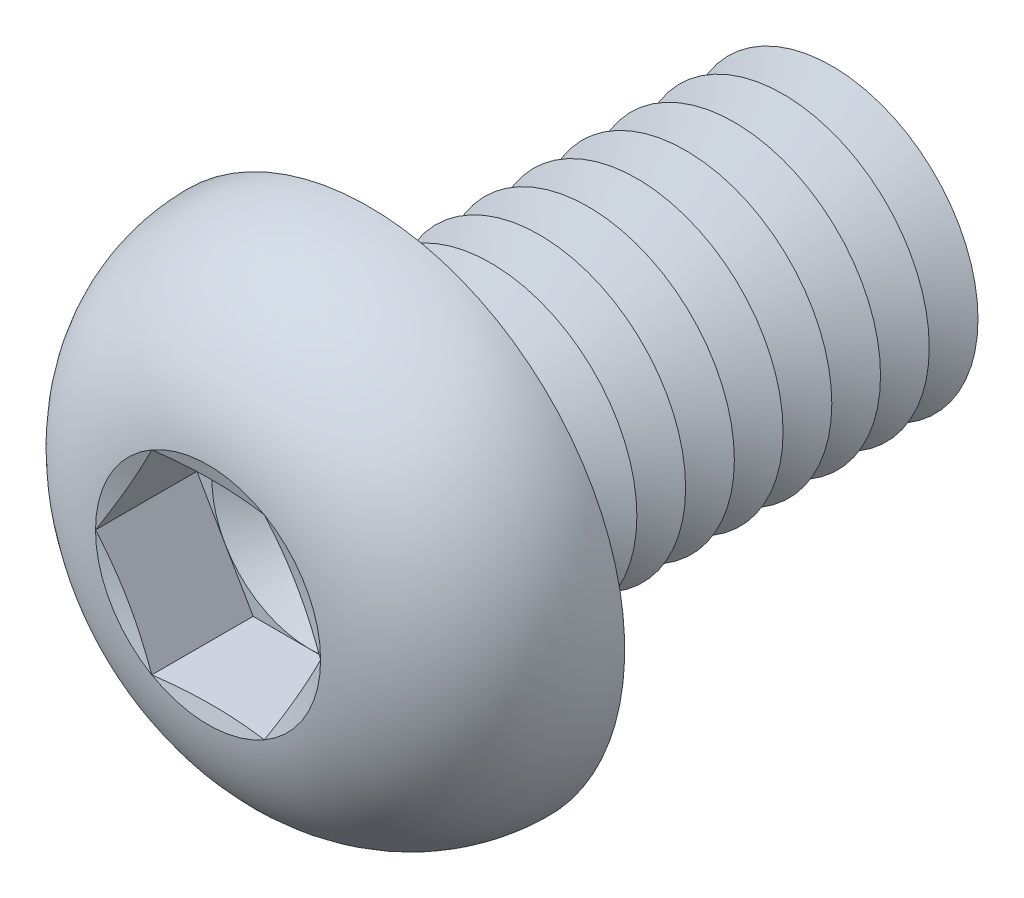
ISO-10303-21;
HEADER;
FILE_DESCRIPTION(('STEP AP214'),'2;1');
FILE_NAME('part.step','',(''),(''),'','','');
FILE_SCHEMA(('AUTOMOTIVE_DESIGN { 1 0 10303 214 1 1 1 1 }'));
ENDSEC;
DATA;
#1=APPLICATION_CONTEXT('core data for automotive mechanical design processes');
#2=APPLICATION_PROTOCOL_DEFINITION('international standard','automotive_design',2000,#1);
#3=PRODUCT_CONTEXT('',#1,'mechanical');
#4=PRODUCT('Part','Part','',(#3));
#5=PRODUCT_RELATED_PRODUCT_CATEGORY('part','',(#4));
#6=PRODUCT_DEFINITION_FORMATION('','',#4);
#7=PRODUCT_DEFINITION_CONTEXT('part definition',#1,'design');
#8=PRODUCT_DEFINITION('design','',#6,#7);
#9=PRODUCT_DEFINITION_SHAPE('','',#8);
#10=(LENGTH_UNIT() NAMED_UNIT(*) SI_UNIT(.MILLI.,.METRE.));
#11=(NAMED_UNIT(*) PLANE_ANGLE_UNIT() SI_UNIT($,.RADIAN.));
#12=(NAMED_UNIT(*) SI_UNIT($,.STERADIAN.) SOLID_ANGLE_UNIT());
#13=UNCERTAINTY_MEASURE_WITH_UNIT(LENGTH_MEASURE(1.E-05),#10,'distance_accuracy_value','');
#14=(GEOMETRIC_REPRESENTATION_CONTEXT(3) GLOBAL_UNCERTAINTY_ASSIGNED_CONTEXT((#13)) GLOBAL_UNIT_ASSIGNED_CONTEXT((#10,
#11,#12)) REPRESENTATION_CONTEXT('',''));
#15=CARTESIAN_POINT('',(0.,0.,0.));
#16=DIRECTION('',(0.,0.,1.));
#17=DIRECTION('',(1.,0.,0.));
#18=AXIS2_PLACEMENT_3D('',#15,#16,#17);
#19=CARTESIAN_POINT('',(0.,0.,1.22));
#20=DIRECTION('',(0.,0.,1.));
#21=DIRECTION('',(1.,0.,0.));
#22=AXIS2_PLACEMENT_3D('',#19,#20,#21);
#23=PLANE('',#22);
#24=CARTESIAN_POINT('',(0.,0.,1.22));
#25=DIRECTION('',(0.,0.,1.));
#26=DIRECTION('',(1.,0.,0.));
#27=AXIS2_PLACEMENT_3D('',#24,#25,#26);
#28=CIRCLE('',#27,1.99999906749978);
#29=CARTESIAN_POINT('',(1.73205,0.999999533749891,1.22));
#30=VERTEX_POINT('',#29);
#31=CARTESIAN_POINT('',(0.,1.99999906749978,1.22));
#32=VERTEX_POINT('',#31);
#33=EDGE_CURVE('E118',#30,#32,#28,.T.);
#34=ORIENTED_EDGE('',*,*,#33,.F.);
#35=DIRECTION('',(-0.5,0.866025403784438,0.));
#36=VECTOR('',#35,1.);
#37=CARTESIAN_POINT('',(2.3094,0.,1.22));
#38=LINE('',#37,#36);
#39=CARTESIAN_POINT('',(1.1547,1.99999906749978,1.22));
#40=VERTEX_POINT('',#39);
#41=EDGE_CURVE('E125',#30,#40,#38,.T.);
#42=ORIENTED_EDGE('',*,*,#41,.T.);
#43=DIRECTION('',(-1.,0.,0.));
#44=VECTOR('',#43,1.);
#45=CARTESIAN_POINT('',(1.1547,1.99999906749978,1.22));
#46=LINE('',#45,#44);
#47=EDGE_CURVE('E136',#40,#32,#46,.T.);
#48=ORIENTED_EDGE('',*,*,#47,.T.);
#49=EDGE_LOOP('',(#34,#42,#48));
#50=FACE_BOUND('',#49,.T.);
#51=ADVANCED_FACE('F39',(#50),#23,.T.);
#52=CARTESIAN_POINT('',(0.,0.,1.22));
#53=DIRECTION('',(0.,0.,1.));
#54=DIRECTION('',(1.,0.,0.));
#55=AXIS2_PLACEMENT_3D('',#52,#53,#54);
#56=CIRCLE('',#55,1.99999906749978);
#57=CARTESIAN_POINT('',(-1.73205,0.999999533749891,1.22));
#58=VERTEX_POINT('',#57);
#59=EDGE_CURVE('E11',#32,#58,#56,.T.);
#60=ORIENTED_EDGE('',*,*,#59,.F.);
#61=CARTESIAN_POINT('',(-1.1547,1.99999906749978,1.22));
#62=VERTEX_POINT('',#61);
#63=EDGE_CURVE('E131',#32,#62,#46,.T.);
#64=ORIENTED_EDGE('',*,*,#63,.T.);
#65=DIRECTION('',(-0.5,-0.866025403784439,0.));
#66=VECTOR('',#65,1.);
#67=CARTESIAN_POINT('',(-1.1547,1.99999906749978,1.22));
#68=LINE('',#67,#66);
#69=EDGE_CURVE('E134',#62,#58,#68,.T.);
#70=ORIENTED_EDGE('',*,*,#69,.T.);
#71=EDGE_LOOP('',(#60,#64,#70));
#72=FACE_BOUND('',#71,.T.);
#73=ADVANCED_FACE('F130',(#72),#23,.T.);
#74=CARTESIAN_POINT('',(-1.73205,-0.999999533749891,1.22));
#75=VERTEX_POINT('',#74);
#76=EDGE_CURVE('E49',#58,#75,#56,.T.);
#77=ORIENTED_EDGE('',*,*,#76,.F.);
#78=CARTESIAN_POINT('',(-2.3094,0.,1.22));
#79=VERTEX_POINT('',#78);
#80=EDGE_CURVE('E143',#58,#79,#68,.T.);
#81=ORIENTED_EDGE('',*,*,#80,.T.);
#82=DIRECTION('',(0.5,-0.866025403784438,0.));
#83=VECTOR('',#82,1.);
#84=CARTESIAN_POINT('',(-2.3094,0.,1.22));
#85=LINE('',#84,#83);
#86=EDGE_CURVE('E152',#79,#75,#85,.T.);
#87=ORIENTED_EDGE('',*,*,#86,.T.);
#88=EDGE_LOOP('',(#77,#81,#87));
#89=FACE_BOUND('',#88,.T.);
#90=ADVANCED_FACE('F348',(#89),#23,.T.);
#91=CARTESIAN_POINT('',(0.,-1.99999906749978,1.22));
#92=VERTEX_POINT('',#91);
#93=EDGE_CURVE('E333',#75,#92,#56,.T.);
#94=ORIENTED_EDGE('',*,*,#93,.F.);
#95=CARTESIAN_POINT('',(-1.1547,-1.99999906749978,1.22));
#96=VERTEX_POINT('',#95);
#97=EDGE_CURVE('E151',#75,#96,#85,.T.);
#98=ORIENTED_EDGE('',*,*,#97,.T.);
#99=DIRECTION('',(1.,0.,0.));
#100=VECTOR('',#99,1.);
#101=CARTESIAN_POINT('',(-1.1547,-1.99999906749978,1.22));
#102=LINE('',#101,#100);
#103=EDGE_CURVE('E157',#96,#92,#102,.T.);
#104=ORIENTED_EDGE('',*,*,#103,.T.);
#105=EDGE_LOOP('',(#94,#98,#104));
#106=FACE_BOUND('',#105,.T.);
#107=ADVANCED_FACE('F341',(#106),#23,.T.);
#108=CARTESIAN_POINT('',(1.73205,-0.999999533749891,1.22));
#109=VERTEX_POINT('',#108);
#110=EDGE_CURVE('E56',#92,#109,#56,.T.);
#111=ORIENTED_EDGE('',*,*,#110,.F.);
#112=CARTESIAN_POINT('',(1.1547,-1.99999906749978,1.22));
#113=VERTEX_POINT('',#112);
#114=EDGE_CURVE('E156',#92,#113,#102,.T.);
#115=ORIENTED_EDGE('',*,*,#114,.T.);
#116=DIRECTION('',(0.5,0.866025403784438,0.));
#117=VECTOR('',#116,1.);
#118=CARTESIAN_POINT('',(1.1547,-1.99999906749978,1.22));
#119=LINE('',#118,#117);
#120=EDGE_CURVE('E162',#113,#109,#119,.T.);
#121=ORIENTED_EDGE('',*,*,#120,.T.);
#122=EDGE_LOOP('',(#111,#115,#121));
#123=FACE_BOUND('',#122,.T.);
#124=ADVANCED_FACE('F388',(#123),#23,.T.);
#125=CARTESIAN_POINT('',(0.,0.,3.3));
#126=DIRECTION('',(0.,0.,1.));
#127=DIRECTION('',(1.,0.,0.));
#128=AXIS2_PLACEMENT_3D('',#125,#126,#127);
#129=CONICAL_SURFACE('',#128,2.3094,1.30899693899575);
#130=CARTESIAN_POINT('',(2.30951547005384,-0.000199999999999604,3.30003094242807));
#131=CARTESIAN_POINT('',(2.26155412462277,0.0828714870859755,3.2871729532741));
#132=CARTESIAN_POINT('',(2.21350580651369,0.16609361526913,3.27549992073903));
#133=CARTESIAN_POINT('',(2.11723944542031,0.332831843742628,3.2549913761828));
#134=CARTESIAN_POINT('',(2.06902134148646,0.416348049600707,3.24615701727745));
#135=CARTESIAN_POINT('',(1.97270782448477,0.583167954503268,3.23184167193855));
#136=CARTESIAN_POINT('',(1.92461306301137,0.666470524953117,3.22634360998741));
#137=CARTESIAN_POINT('',(1.82836219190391,0.83318192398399,3.21897125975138));
#138=CARTESIAN_POINT('',(1.78020609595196,0.91659072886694,3.21709626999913));
#139=CARTESIAN_POINT('',(1.68389390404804,1.08340833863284,3.21709626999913));
#140=CARTESIAN_POINT('',(1.63573780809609,1.16681714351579,3.21897125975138));
#141=CARTESIAN_POINT('',(1.53948693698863,1.33352854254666,3.22634360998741));
#142=CARTESIAN_POINT('',(1.49139217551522,1.41683111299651,3.23184167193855));
#143=CARTESIAN_POINT('',(1.39507865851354,1.58365101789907,3.24615701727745));
#144=CARTESIAN_POINT('',(1.34686055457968,1.66716722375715,3.2549913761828));
#145=CARTESIAN_POINT('',(1.25059419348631,1.83390545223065,3.27549992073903));
#146=CARTESIAN_POINT('',(1.20254587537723,1.91712758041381,3.2871729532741));
#147=CARTESIAN_POINT('',(1.15458452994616,2.00019906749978,3.30003094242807));
#148=B_SPLINE_CURVE_WITH_KNOTS('',3,(#130,#131,#132,#133,#134,#135,#136,#137,#138,#139,#140,
#141,#142,#143,#144,#145,#146,#147),.UNSPECIFIED.,.F.,.F.,(4,2,2,2,2,2,2,2,4),(0.,
0.290357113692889,0.580832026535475,0.869807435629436,1.15872689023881,1.44764634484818,
1.73662175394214,2.02709666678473,2.31745378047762),.UNSPECIFIED.);
#149=CARTESIAN_POINT('',(2.3094,0.,3.3));
#150=VERTEX_POINT('',#149);
#151=CARTESIAN_POINT('',(1.15469999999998,1.99999906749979,3.3));
#152=VERTEX_POINT('',#151);
#153=EDGE_CURVE('E220',#150,#152,#148,.T.);
#154=ORIENTED_EDGE('',*,*,#153,.F.);
#155=CARTESIAN_POINT('',(0.,0.,3.3));
#156=DIRECTION('',(0.,0.,-1.));
#157=DIRECTION('',(-1.,0.,0.));
#158=AXIS2_PLACEMENT_3D('',#155,#156,#157);
#159=CIRCLE('',#158,2.3094);
#160=EDGE_CURVE('E378',#152,#150,#159,.T.);
#161=ORIENTED_EDGE('',*,*,#160,.F.);
#162=EDGE_LOOP('',(#154,#161));
#163=FACE_BOUND('',#162,.T.);
#164=ADVANCED_FACE('F429',(#163),#129,.F.);
#165=CARTESIAN_POINT('',(1.15458452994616,-2.00019906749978,3.30003094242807));
#166=CARTESIAN_POINT('',(1.20254587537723,-1.91712758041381,3.2871729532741));
#167=CARTESIAN_POINT('',(1.25059419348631,-1.83390545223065,3.27549992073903));
#168=CARTESIAN_POINT('',(1.34686055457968,-1.66716722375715,3.2549913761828));
#169=CARTESIAN_POINT('',(1.39507865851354,-1.58365101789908,3.24615701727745));
#170=CARTESIAN_POINT('',(1.49139217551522,-1.41683111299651,3.23184167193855));
#171=CARTESIAN_POINT('',(1.53948693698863,-1.33352854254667,3.22634360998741));
#172=CARTESIAN_POINT('',(1.63573780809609,-1.16681714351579,3.21897125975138));
#173=CARTESIAN_POINT('',(1.68389390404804,-1.08340833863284,3.21709626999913));
#174=CARTESIAN_POINT('',(1.78020609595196,-0.916590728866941,3.21709626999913));
#175=CARTESIAN_POINT('',(1.82836219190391,-0.833181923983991,3.21897125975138));
#176=CARTESIAN_POINT('',(1.92461306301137,-0.666470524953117,3.22634360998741));
#177=CARTESIAN_POINT('',(1.97270782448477,-0.583167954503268,3.23184167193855));
#178=CARTESIAN_POINT('',(2.06902134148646,-0.416348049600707,3.24615701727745));
#179=CARTESIAN_POINT('',(2.11723944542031,-0.332831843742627,3.2549913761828));
#180=CARTESIAN_POINT('',(2.21350580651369,-0.166093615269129,3.27549992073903));
#181=CARTESIAN_POINT('',(2.26155412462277,-0.082871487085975,3.2871729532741));
#182=CARTESIAN_POINT('',(2.30951547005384,0.000200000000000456,3.30003094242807));
#183=B_SPLINE_CURVE_WITH_KNOTS('',3,(#165,#166,#167,#168,#169,#170,#171,#172,#173,#174,#175,
#176,#177,#178,#179,#180,#181,#182),.UNSPECIFIED.,.F.,.F.,(4,2,2,2,2,2,2,2,4),(0.,
0.290357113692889,0.580832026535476,0.869807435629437,1.15872689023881,1.44764634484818,
1.73662175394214,2.02709666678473,2.31745378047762),.UNSPECIFIED.);
#184=CARTESIAN_POINT('',(1.1547,-1.99999906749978,3.3));
#185=VERTEX_POINT('',#184);
#186=EDGE_CURVE('E229',#185,#150,#183,.T.);
#187=ORIENTED_EDGE('',*,*,#186,.F.);
#188=EDGE_CURVE('E380',#150,#185,#159,.T.);
#189=ORIENTED_EDGE('',*,*,#188,.F.);
#190=EDGE_LOOP('',(#187,#189));
#191=FACE_BOUND('',#190,.T.);
#192=ADVANCED_FACE('F434',(#191),#129,.F.);
#193=CARTESIAN_POINT('',(-3.4849337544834,-1.99999906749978,3.75783251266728));
#194=CARTESIAN_POINT('',(-3.40057136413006,-1.99999906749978,3.7382285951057));
#195=CARTESIAN_POINT('',(-3.31617090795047,-1.99999906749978,3.71878852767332));
#196=CARTESIAN_POINT('',(-3.14727791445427,-1.99999906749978,3.68030638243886));
#197=CARTESIAN_POINT('',(-3.06278537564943,-1.99999906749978,3.66126431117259));
#198=CARTESIAN_POINT('',(-2.80911712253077,-1.99999906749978,3.604834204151));
#199=CARTESIAN_POINT('',(-2.63978343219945,-1.99999906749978,3.5681499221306));
#200=CARTESIAN_POINT('',(-2.29895421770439,-1.99999906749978,3.49717072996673));
#201=CARTESIAN_POINT('',(-2.12745330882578,-1.99999906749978,3.4629014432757));
#202=CARTESIAN_POINT('',(-1.78364663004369,-1.99999906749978,3.39849485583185));
#203=CARTESIAN_POINT('',(-1.61134079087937,-1.99999906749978,3.36835791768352));
#204=CARTESIAN_POINT('',(-1.27040784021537,-1.99999906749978,3.31501553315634));
#205=CARTESIAN_POINT('',(-1.10180724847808,-1.99999906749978,3.29164468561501));
#206=CARTESIAN_POINT('',(-0.76364137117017,-1.99999906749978,3.2533727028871));
#207=CARTESIAN_POINT('',(-0.594076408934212,-1.99999906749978,3.23846888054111));
#208=CARTESIAN_POINT('',(-0.33964912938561,-1.99999906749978,3.22431372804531));
#209=CARTESIAN_POINT('',(-0.255009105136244,-1.99999906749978,3.22096057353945));
#210=CARTESIAN_POINT('',(-0.0856618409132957,-1.99999906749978,3.21711210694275));
#211=CARTESIAN_POINT('',(-0.000954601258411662,-1.99999906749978,3.21661678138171));
#212=CARTESIAN_POINT('',(0.168430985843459,-1.99999906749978,3.21851478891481));
#213=CARTESIAN_POINT('',(0.253109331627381,-1.99999906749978,3.22090826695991));
#214=CARTESIAN_POINT('',(0.422344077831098,-1.99999906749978,3.22845792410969));
#215=CARTESIAN_POINT('',(0.506900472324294,-1.99999906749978,3.23361423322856));
#216=CARTESIAN_POINT('',(0.712240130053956,-1.99999906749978,3.24921577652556));
#217=CARTESIAN_POINT('',(0.832922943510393,-1.99999906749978,3.26098285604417));
#218=CARTESIAN_POINT('',(1.07378161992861,-1.99999906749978,3.28874908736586));
#219=CARTESIAN_POINT('',(1.1939575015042,-1.99999906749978,3.30474808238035));
#220=CARTESIAN_POINT('',(1.43419655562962,-1.99999906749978,3.34009172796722));
#221=CARTESIAN_POINT('',(1.55425817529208,-1.99999906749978,3.35944677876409));
#222=CARTESIAN_POINT('',(1.79394991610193,-1.99999906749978,3.40067076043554));
#223=CARTESIAN_POINT('',(1.91358001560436,-1.99999906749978,3.42253981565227));
#224=CARTESIAN_POINT('',(2.15493405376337,-1.99999906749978,3.46864194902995));
#225=CARTESIAN_POINT('',(2.27665041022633,-1.99999906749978,3.49291441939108));
#226=CARTESIAN_POINT('',(2.51977680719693,-1.99999906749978,3.54294628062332));
#227=CARTESIAN_POINT('',(2.64118684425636,-1.99999906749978,3.56870568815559));
#228=CARTESIAN_POINT('',(2.88310060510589,-1.99999906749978,3.6212089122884));
#229=CARTESIAN_POINT('',(3.00360566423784,-1.99999906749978,3.6479466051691));
#230=CARTESIAN_POINT('',(3.24441021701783,-1.99999906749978,3.70229477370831));
#231=CARTESIAN_POINT('',(3.36470972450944,-1.99999906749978,3.7299051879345));
#232=CARTESIAN_POINT('',(3.4849337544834,-1.99999906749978,3.75783251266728));
#233=B_SPLINE_CURVE_WITH_KNOTS('',3,(#193,#194,#195,#196,#197,#198,#199,#200,#201,#202,#203,
#204,#205,#206,#207,#208,#209,#210,#211,#212,#213,#214,#215,#216,#217,#218,#219,#220,#221,#222,
#223,#224,#225,#226,#227,#228,#229,#230,#231,#232),.UNSPECIFIED.,.F.,.F.,(4,2,2,2,2,2,2,2,2,2,2,
2,2,2,2,2,2,2,2,4),(0.,0.259830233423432,0.519664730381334,1.03943435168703,1.56407662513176,
2.08876490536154,2.59926476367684,3.10960251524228,3.36367930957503,3.61775490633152,
3.87184325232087,4.1259435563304,4.48960924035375,4.85326145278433,5.21806142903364,
5.58287945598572,5.95520617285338,6.32753706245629,6.69784064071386,7.06811821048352),.UNSPECIFIED.);
#234=CARTESIAN_POINT('',(-1.1547,-1.99999906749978,3.3));
#235=VERTEX_POINT('',#234);
#236=EDGE_CURVE('E360',#235,#185,#233,.T.);
#237=ORIENTED_EDGE('',*,*,#236,.F.);
#238=EDGE_CURVE('E368',#185,#235,#159,.T.);
#239=ORIENTED_EDGE('',*,*,#238,.F.);
#240=EDGE_LOOP('',(#237,#239));
#241=FACE_BOUND('',#240,.T.);
#242=ADVANCED_FACE('F488',(#241),#129,.F.);
#243=CARTESIAN_POINT('',(-2.30951547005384,0.000200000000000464,3.30003094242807));
#244=CARTESIAN_POINT('',(-2.26155412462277,-0.0828714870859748,3.2871729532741));
#245=CARTESIAN_POINT('',(-2.21350580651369,-0.166093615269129,3.27549992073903));
#246=CARTESIAN_POINT('',(-2.11723944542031,-0.332831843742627,3.2549913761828));
#247=CARTESIAN_POINT('',(-2.06902134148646,-0.416348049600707,3.24615701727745));
#248=CARTESIAN_POINT('',(-1.97270782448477,-0.583167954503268,3.23184167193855));
#249=CARTESIAN_POINT('',(-1.92461306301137,-0.666470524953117,3.22634360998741));
#250=CARTESIAN_POINT('',(-1.82836219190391,-0.833181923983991,3.21897125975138));
#251=CARTESIAN_POINT('',(-1.78020609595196,-0.916590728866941,3.21709626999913));
#252=CARTESIAN_POINT('',(-1.68389390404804,-1.08340833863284,3.21709626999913));
#253=CARTESIAN_POINT('',(-1.63573780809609,-1.16681714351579,3.21897125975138));
#254=CARTESIAN_POINT('',(-1.53948693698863,-1.33352854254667,3.22634360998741));
#255=CARTESIAN_POINT('',(-1.49139217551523,-1.41683111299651,3.23184167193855));
#256=CARTESIAN_POINT('',(-1.39507865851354,-1.58365101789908,3.24615701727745));
#257=CARTESIAN_POINT('',(-1.34686055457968,-1.66716722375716,3.2549913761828));
#258=CARTESIAN_POINT('',(-1.25059419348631,-1.83390545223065,3.27549992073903));
#259=CARTESIAN_POINT('',(-1.20254587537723,-1.91712758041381,3.2871729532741));
#260=CARTESIAN_POINT('',(-1.15458452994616,-2.00019906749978,3.30003094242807));
#261=B_SPLINE_CURVE_WITH_KNOTS('',3,(#243,#244,#245,#246,#247,#248,#249,#250,#251,#252,#253,
#254,#255,#256,#257,#258,#259,#260),.UNSPECIFIED.,.F.,.F.,(4,2,2,2,2,2,2,2,4),(0.,
0.290357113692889,0.580832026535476,0.869807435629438,1.15872689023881,1.44764634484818,
1.73662175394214,2.02709666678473,2.31745378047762),.UNSPECIFIED.);
#262=CARTESIAN_POINT('',(-2.3094,0.,3.3));
#263=VERTEX_POINT('',#262);
#264=EDGE_CURVE('E353',#263,#235,#261,.T.);
#265=ORIENTED_EDGE('',*,*,#264,.F.);
#266=EDGE_CURVE('E315',#235,#263,#159,.T.);
#267=ORIENTED_EDGE('',*,*,#266,.F.);
#268=EDGE_LOOP('',(#265,#267));
#269=FACE_BOUND('',#268,.T.);
#270=ADVANCED_FACE('F357',(#269),#129,.F.);
#271=CARTESIAN_POINT('',(-1.15458452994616,2.00019906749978,3.30003094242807));
#272=CARTESIAN_POINT('',(-1.20254587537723,1.91712758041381,3.2871729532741));
#273=CARTESIAN_POINT('',(-1.25059419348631,1.83390545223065,3.27549992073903));
#274=CARTESIAN_POINT('',(-1.34686055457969,1.66716722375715,3.2549913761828));
#275=CARTESIAN_POINT('',(-1.39507865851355,1.58365101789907,3.24615701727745));
#276=CARTESIAN_POINT('',(-1.49139217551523,1.41683111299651,3.23184167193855));
#277=CARTESIAN_POINT('',(-1.53948693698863,1.33352854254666,3.22634360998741));
#278=CARTESIAN_POINT('',(-1.63573780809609,1.16681714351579,3.21897125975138));
#279=CARTESIAN_POINT('',(-1.68389390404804,1.08340833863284,3.21709626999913));
#280=CARTESIAN_POINT('',(-1.78020609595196,0.91659072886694,3.21709626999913));
#281=CARTESIAN_POINT('',(-1.82836219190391,0.83318192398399,3.21897125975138));
#282=CARTESIAN_POINT('',(-1.92461306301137,0.666470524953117,3.22634360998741));
#283=CARTESIAN_POINT('',(-1.97270782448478,0.583167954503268,3.23184167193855));
#284=CARTESIAN_POINT('',(-2.06902134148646,0.416348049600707,3.24615701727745));
#285=CARTESIAN_POINT('',(-2.11723944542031,0.332831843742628,3.2549913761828));
#286=CARTESIAN_POINT('',(-2.21350580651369,0.16609361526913,3.27549992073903));
#287=CARTESIAN_POINT('',(-2.26155412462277,0.0828714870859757,3.2871729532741));
#288=CARTESIAN_POINT('',(-2.30951547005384,-0.000199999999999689,3.30003094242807));
#289=B_SPLINE_CURVE_WITH_KNOTS('',3,(#271,#272,#273,#274,#275,#276,#277,#278,#279,#280,#281,
#282,#283,#284,#285,#286,#287,#288),.UNSPECIFIED.,.F.,.F.,(4,2,2,2,2,2,2,2,4),(0.,
0.290357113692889,0.580832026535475,0.869807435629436,1.15872689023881,1.44764634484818,
1.73662175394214,2.02709666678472,2.31745378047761),.UNSPECIFIED.);
#290=CARTESIAN_POINT('',(-1.1547,1.99999906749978,3.3));
#291=VERTEX_POINT('',#290);
#292=EDGE_CURVE('E194',#291,#263,#289,.T.);
#293=ORIENTED_EDGE('',*,*,#292,.F.);
#294=EDGE_CURVE('E316',#263,#291,#159,.T.);
#295=ORIENTED_EDGE('',*,*,#294,.F.);
#296=EDGE_LOOP('',(#293,#295));
#297=FACE_BOUND('',#296,.T.);
#298=ADVANCED_FACE('F370',(#297),#129,.F.);
#299=CARTESIAN_POINT('',(0.,0.,-6.5));
#300=DIRECTION('',(0.,0.,1.));
#301=DIRECTION('',(1.,0.,0.));
#302=AXIS2_PLACEMENT_3D('',#299,#300,#301);
#303=CONICAL_SURFACE('',#302,3.,1.0471975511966);
#304=CARTESIAN_POINT('',(0.,0.,-7.));
#305=DIRECTION('',(0.,0.,1.));
#306=DIRECTION('',(1.,0.,0.));
#307=AXIS2_PLACEMENT_3D('',#304,#305,#306);
#308=CIRCLE('',#307,2.13397459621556);
#309=CARTESIAN_POINT('',(2.13397459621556,0.,-7.));
#310=VERTEX_POINT('',#309);
#311=EDGE_CURVE('E287',#310,#310,#308,.T.);
#312=ORIENTED_EDGE('',*,*,#311,.T.);
#313=EDGE_LOOP('',(#312));
#314=FACE_BOUND('',#313,.T.);
#315=CARTESIAN_POINT('',(0.,0.,-6.5));
#316=DIRECTION('',(0.,0.,1.));
#317=DIRECTION('',(1.,0.,0.));
#318=AXIS2_PLACEMENT_3D('',#315,#316,#317);
#319=CIRCLE('',#318,3.);
#320=CARTESIAN_POINT('',(3.,0.,-6.5));
#321=VERTEX_POINT('',#320);
#322=EDGE_CURVE('E283',#321,#321,#319,.T.);
#323=ORIENTED_EDGE('',*,*,#322,.F.);
#324=EDGE_LOOP('',(#323));
#325=FACE_BOUND('',#324,.T.);
#326=ADVANCED_FACE('F478',(#314,#325),#303,.T.);
#327=CARTESIAN_POINT('',(0.,0.,-7.));
#328=DIRECTION('',(0.,0.,-1.));
#329=DIRECTION('',(-1.,0.,0.));
#330=AXIS2_PLACEMENT_3D('',#327,#328,#329);
#331=CONICAL_SURFACE('',#330,2.13397459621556,1.0471975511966);
#332=CARTESIAN_POINT('',(0.,0.,-7.5));
#333=DIRECTION('',(0.,0.,1.));
#334=DIRECTION('',(1.,0.,0.));
#335=AXIS2_PLACEMENT_3D('',#332,#333,#334);
#336=CIRCLE('',#335,3.);
#337=CARTESIAN_POINT('',(3.,0.,-7.5));
#338=VERTEX_POINT('',#337);
#339=EDGE_CURVE('E291',#338,#338,#336,.T.);
#340=ORIENTED_EDGE('',*,*,#339,.T.);
#341=EDGE_LOOP('',(#340));
#342=FACE_BOUND('',#341,.T.);
#343=ORIENTED_EDGE('',*,*,#311,.F.);
#344=EDGE_LOOP('',(#343));
#345=FACE_BOUND('',#344,.T.);
#346=ADVANCED_FACE('F672',(#342,#345),#331,.T.);
#347=CARTESIAN_POINT('',(0.,3.00000000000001,-10.));
#348=DIRECTION('',(0.,0.,-1.));
#349=DIRECTION('',(-1.,0.,0.));
#350=AXIS2_PLACEMENT_3D('',#347,#348,#349);
#351=PLANE('',#350);
#352=CARTESIAN_POINT('',(0.,0.,-10.));
#353=DIRECTION('',(0.,0.,1.));
#354=DIRECTION('',(1.,0.,0.));
#355=AXIS2_PLACEMENT_3D('',#352,#353,#354);
#356=CIRCLE('',#355,2.13397459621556);
#357=CARTESIAN_POINT('',(2.13397459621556,0.,-10.));
#358=VERTEX_POINT('',#357);
#359=EDGE_CURVE('E311',#358,#358,#356,.T.);
#360=ORIENTED_EDGE('',*,*,#359,.F.);
#361=EDGE_LOOP('',(#360));
#362=FACE_BOUND('',#361,.T.);
#363=ADVANCED_FACE('F677',(#362),#351,.T.);
#364=CARTESIAN_POINT('',(0.,0.,-9.5));
#365=DIRECTION('',(0.,0.,1.));
#366=DIRECTION('',(1.,0.,0.));
#367=AXIS2_PLACEMENT_3D('',#364,#365,#366);
#368=CONICAL_SURFACE('',#367,3.,1.0471975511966);
#369=ORIENTED_EDGE('',*,*,#359,.T.);
#370=EDGE_LOOP('',(#369));
#371=FACE_BOUND('',#370,.T.);
#372=CARTESIAN_POINT('',(0.,0.,-9.5));
#373=DIRECTION('',(0.,0.,1.));
#374=DIRECTION('',(1.,0.,0.));
#375=AXIS2_PLACEMENT_3D('',#372,#373,#374);
#376=CIRCLE('',#375,3.);
#377=CARTESIAN_POINT('',(3.,0.,-9.5));
#378=VERTEX_POINT('',#377);
#379=EDGE_CURVE('E307',#378,#378,#376,.T.);
#380=ORIENTED_EDGE('',*,*,#379,.F.);
#381=EDGE_LOOP('',(#380));
#382=FACE_BOUND('',#381,.T.);
#383=ADVANCED_FACE('F665',(#371,#382),#368,.T.);
#384=CARTESIAN_POINT('',(0.,0.,-9.));
#385=DIRECTION('',(0.,0.,-1.));
#386=DIRECTION('',(-1.,0.,0.));
#387=AXIS2_PLACEMENT_3D('',#384,#385,#386);
#388=CONICAL_SURFACE('',#387,2.13397459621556,1.0471975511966);
#389=ORIENTED_EDGE('',*,*,#379,.T.);
#390=EDGE_LOOP('',(#389));
#391=FACE_BOUND('',#390,.T.);
#392=CARTESIAN_POINT('',(0.,0.,-9.));
#393=DIRECTION('',(0.,0.,1.));
#394=DIRECTION('',(1.,0.,0.));
#395=AXIS2_PLACEMENT_3D('',#392,#393,#394);
#396=CIRCLE('',#395,2.13397459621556);
#397=CARTESIAN_POINT('',(2.13397459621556,0.,-9.));
#398=VERTEX_POINT('',#397);
#399=EDGE_CURVE('E303',#398,#398,#396,.T.);
#400=ORIENTED_EDGE('',*,*,#399,.F.);
#401=EDGE_LOOP('',(#400));
#402=FACE_BOUND('',#401,.T.);
#403=ADVANCED_FACE('F655',(#391,#402),#388,.T.);
#404=CARTESIAN_POINT('',(0.,0.,-8.5));
#405=DIRECTION('',(0.,0.,1.));
#406=DIRECTION('',(1.,0.,0.));
#407=AXIS2_PLACEMENT_3D('',#404,#405,#406);
#408=CONICAL_SURFACE('',#407,3.,1.0471975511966);
#409=ORIENTED_EDGE('',*,*,#399,.T.);
#410=EDGE_LOOP('',(#409));
#411=FACE_BOUND('',#410,.T.);
#412=CARTESIAN_POINT('',(0.,0.,-8.5));
#413=DIRECTION('',(0.,0.,1.));
#414=DIRECTION('',(1.,0.,0.));
#415=AXIS2_PLACEMENT_3D('',#412,#413,#414);
#416=CIRCLE('',#415,3.);
#417=CARTESIAN_POINT('',(3.,0.,-8.5));
#418=VERTEX_POINT('',#417);
#419=EDGE_CURVE('E299',#418,#418,#416,.T.);
#420=ORIENTED_EDGE('',*,*,#419,.F.);
#421=EDGE_LOOP('',(#420));
#422=FACE_BOUND('',#421,.T.);
#423=ADVANCED_FACE('F645',(#411,#422),#408,.T.);
#424=CARTESIAN_POINT('',(0.,0.,-8.));
#425=DIRECTION('',(0.,0.,-1.));
#426=DIRECTION('',(-1.,0.,0.));
#427=AXIS2_PLACEMENT_3D('',#424,#425,#426);
#428=CONICAL_SURFACE('',#427,2.13397459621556,1.0471975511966);
#429=ORIENTED_EDGE('',*,*,#419,.T.);
#430=EDGE_LOOP('',(#429));
#431=FACE_BOUND('',#430,.T.);
#432=CARTESIAN_POINT('',(0.,0.,-8.));
#433=DIRECTION('',(0.,0.,1.));
#434=DIRECTION('',(1.,0.,0.));
#435=AXIS2_PLACEMENT_3D('',#432,#433,#434);
#436=CIRCLE('',#435,2.13397459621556);
#437=CARTESIAN_POINT('',(2.13397459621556,0.,-8.));
#438=VERTEX_POINT('',#437);
#439=EDGE_CURVE('E295',#438,#438,#436,.T.);
#440=ORIENTED_EDGE('',*,*,#439,.F.);
#441=EDGE_LOOP('',(#440));
#442=FACE_BOUND('',#441,.T.);
#443=ADVANCED_FACE('F635',(#431,#442),#428,.T.);
#444=CARTESIAN_POINT('',(0.,0.,-7.5));
#445=DIRECTION('',(0.,0.,1.));
#446=DIRECTION('',(1.,0.,0.));
#447=AXIS2_PLACEMENT_3D('',#444,#445,#446);
#448=CONICAL_SURFACE('',#447,3.,1.0471975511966);
#449=ORIENTED_EDGE('',*,*,#439,.T.);
#450=EDGE_LOOP('',(#449));
#451=FACE_BOUND('',#450,.T.);
#452=ORIENTED_EDGE('',*,*,#339,.F.);
#453=EDGE_LOOP('',(#452));
#454=FACE_BOUND('',#453,.T.);
#455=ADVANCED_FACE('F625',(#451,#454),#448,.T.);
#456=CARTESIAN_POINT('',(0.,0.,-5.5));
#457=DIRECTION('',(0.,0.,1.));
#458=DIRECTION('',(1.,0.,0.));
#459=AXIS2_PLACEMENT_3D('',#456,#457,#458);
#460=CONICAL_SURFACE('',#459,3.,1.0471975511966);
#461=CARTESIAN_POINT('',(0.,0.,-6.));
#462=DIRECTION('',(0.,0.,1.));
#463=DIRECTION('',(1.,0.,0.));
#464=AXIS2_PLACEMENT_3D('',#461,#462,#463);
#465=CIRCLE('',#464,2.13397459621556);
#466=CARTESIAN_POINT('',(2.13397459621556,0.,-6.));
#467=VERTEX_POINT('',#466);
#468=EDGE_CURVE('E279',#467,#467,#465,.T.);
#469=ORIENTED_EDGE('',*,*,#468,.T.);
#470=EDGE_LOOP('',(#469));
#471=FACE_BOUND('',#470,.T.);
#472=CARTESIAN_POINT('',(0.,0.,-5.5));
#473=DIRECTION('',(0.,0.,1.));
#474=DIRECTION('',(1.,0.,0.));
#475=AXIS2_PLACEMENT_3D('',#472,#473,#474);
#476=CIRCLE('',#475,3.);
#477=CARTESIAN_POINT('',(3.,0.,-5.5));
#478=VERTEX_POINT('',#477);
#479=EDGE_CURVE('E275',#478,#478,#476,.T.);
#480=ORIENTED_EDGE('',*,*,#479,.F.);
#481=EDGE_LOOP('',(#480));
#482=FACE_BOUND('',#481,.T.);
#483=ADVANCED_FACE('F615',(#471,#482),#460,.T.);
#484=CARTESIAN_POINT('',(0.,0.,-6.));
#485=DIRECTION('',(0.,0.,-1.));
#486=DIRECTION('',(-1.,0.,0.));
#487=AXIS2_PLACEMENT_3D('',#484,#485,#486);
#488=CONICAL_SURFACE('',#487,2.13397459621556,1.0471975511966);
#489=ORIENTED_EDGE('',*,*,#322,.T.);
#490=EDGE_LOOP('',(#489));
#491=FACE_BOUND('',#490,.T.);
#492=ORIENTED_EDGE('',*,*,#468,.F.);
#493=EDGE_LOOP('',(#492));
#494=FACE_BOUND('',#493,.T.);
#495=ADVANCED_FACE('F605',(#491,#494),#488,.T.);
#496=CARTESIAN_POINT('',(0.,0.,-4.5));
#497=DIRECTION('',(0.,0.,1.));
#498=DIRECTION('',(1.,0.,0.));
#499=AXIS2_PLACEMENT_3D('',#496,#497,#498);
#500=CONICAL_SURFACE('',#499,3.,1.0471975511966);
#501=CARTESIAN_POINT('',(0.,0.,-5.));
#502=DIRECTION('',(0.,0.,1.));
#503=DIRECTION('',(1.,0.,0.));
#504=AXIS2_PLACEMENT_3D('',#501,#502,#503);
#505=CIRCLE('',#504,2.13397459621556);
#506=CARTESIAN_POINT('',(2.13397459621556,0.,-5.));
#507=VERTEX_POINT('',#506);
#508=EDGE_CURVE('E271',#507,#507,#505,.T.);
#509=ORIENTED_EDGE('',*,*,#508,.T.);
#510=EDGE_LOOP('',(#509));
#511=FACE_BOUND('',#510,.T.);
#512=CARTESIAN_POINT('',(0.,0.,-4.5));
#513=DIRECTION('',(0.,0.,1.));
#514=DIRECTION('',(1.,0.,0.));
#515=AXIS2_PLACEMENT_3D('',#512,#513,#514);
#516=CIRCLE('',#515,3.);
#517=CARTESIAN_POINT('',(3.,0.,-4.5));
#518=VERTEX_POINT('',#517);
#519=EDGE_CURVE('E267',#518,#518,#516,.T.);
#520=ORIENTED_EDGE('',*,*,#519,.F.);
#521=EDGE_LOOP('',(#520));
#522=FACE_BOUND('',#521,.T.);
#523=ADVANCED_FACE('F595',(#511,#522),#500,.T.);
#524=CARTESIAN_POINT('',(0.,0.,-5.));
#525=DIRECTION('',(0.,0.,-1.));
#526=DIRECTION('',(-1.,0.,0.));
#527=AXIS2_PLACEMENT_3D('',#524,#525,#526);
#528=CONICAL_SURFACE('',#527,2.13397459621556,1.0471975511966);
#529=ORIENTED_EDGE('',*,*,#479,.T.);
#530=EDGE_LOOP('',(#529));
#531=FACE_BOUND('',#530,.T.);
#532=ORIENTED_EDGE('',*,*,#508,.F.);
#533=EDGE_LOOP('',(#532));
#534=FACE_BOUND('',#533,.T.);
#535=ADVANCED_FACE('F585',(#531,#534),#528,.T.);
#536=CARTESIAN_POINT('',(0.,0.,-3.5));
#537=DIRECTION('',(0.,0.,1.));
#538=DIRECTION('',(1.,0.,0.));
#539=AXIS2_PLACEMENT_3D('',#536,#537,#538);
#540=CONICAL_SURFACE('',#539,3.,1.0471975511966);
#541=CARTESIAN_POINT('',(0.,0.,-4.));
#542=DIRECTION('',(0.,0.,1.));
#543=DIRECTION('',(1.,0.,0.));
#544=AXIS2_PLACEMENT_3D('',#541,#542,#543);
#545=CIRCLE('',#544,2.13397459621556);
#546=CARTESIAN_POINT('',(2.13397459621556,0.,-4.));
#547=VERTEX_POINT('',#546);
#548=EDGE_CURVE('E263',#547,#547,#545,.T.);
#549=ORIENTED_EDGE('',*,*,#548,.T.);
#550=EDGE_LOOP('',(#549));
#551=FACE_BOUND('',#550,.T.);
#552=CARTESIAN_POINT('',(0.,0.,-3.5));
#553=DIRECTION('',(0.,0.,1.));
#554=DIRECTION('',(1.,0.,0.));
#555=AXIS2_PLACEMENT_3D('',#552,#553,#554);
#556=CIRCLE('',#555,3.);
#557=CARTESIAN_POINT('',(3.,0.,-3.5));
#558=VERTEX_POINT('',#557);
#559=EDGE_CURVE('E259',#558,#558,#556,.T.);
#560=ORIENTED_EDGE('',*,*,#559,.F.);
#561=EDGE_LOOP('',(#560));
#562=FACE_BOUND('',#561,.T.);
#563=ADVANCED_FACE('F575',(#551,#562),#540,.T.);
#564=CARTESIAN_POINT('',(0.,0.,-4.));
#565=DIRECTION('',(0.,0.,-1.));
#566=DIRECTION('',(-1.,0.,0.));
#567=AXIS2_PLACEMENT_3D('',#564,#565,#566);
#568=CONICAL_SURFACE('',#567,2.13397459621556,1.0471975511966);
#569=ORIENTED_EDGE('',*,*,#519,.T.);
#570=EDGE_LOOP('',(#569));
#571=FACE_BOUND('',#570,.T.);
#572=ORIENTED_EDGE('',*,*,#548,.F.);
#573=EDGE_LOOP('',(#572));
#574=FACE_BOUND('',#573,.T.);
#575=ADVANCED_FACE('F565',(#571,#574),#568,.T.);
#576=CARTESIAN_POINT('',(0.,0.,-2.5));
#577=DIRECTION('',(0.,0.,1.));
#578=DIRECTION('',(1.,0.,0.));
#579=AXIS2_PLACEMENT_3D('',#576,#577,#578);
#580=CONICAL_SURFACE('',#579,3.,1.0471975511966);
#581=CARTESIAN_POINT('',(0.,0.,-3.));
#582=DIRECTION('',(0.,0.,1.));
#583=DIRECTION('',(1.,0.,0.));
#584=AXIS2_PLACEMENT_3D('',#581,#582,#583);
#585=CIRCLE('',#584,2.13397459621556);
#586=CARTESIAN_POINT('',(2.13397459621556,0.,-3.));
#587=VERTEX_POINT('',#586);
#588=EDGE_CURVE('E255',#587,#587,#585,.T.);
#589=ORIENTED_EDGE('',*,*,#588,.T.);
#590=EDGE_LOOP('',(#589));
#591=FACE_BOUND('',#590,.T.);
#592=CARTESIAN_POINT('',(0.,0.,-2.5));
#593=DIRECTION('',(0.,0.,1.));
#594=DIRECTION('',(1.,0.,0.));
#595=AXIS2_PLACEMENT_3D('',#592,#593,#594);
#596=CIRCLE('',#595,3.);
#597=CARTESIAN_POINT('',(3.,0.,-2.5));
#598=VERTEX_POINT('',#597);
#599=EDGE_CURVE('E251',#598,#598,#596,.T.);
#600=ORIENTED_EDGE('',*,*,#599,.F.);
#601=EDGE_LOOP('',(#600));
#602=FACE_BOUND('',#601,.T.);
#603=ADVANCED_FACE('F555',(#591,#602),#580,.T.);
#604=CARTESIAN_POINT('',(0.,0.,-3.));
#605=DIRECTION('',(0.,0.,-1.));
#606=DIRECTION('',(-1.,0.,0.));
#607=AXIS2_PLACEMENT_3D('',#604,#605,#606);
#608=CONICAL_SURFACE('',#607,2.13397459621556,1.0471975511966);
#609=ORIENTED_EDGE('',*,*,#559,.T.);
#610=EDGE_LOOP('',(#609));
#611=FACE_BOUND('',#610,.T.);
#612=ORIENTED_EDGE('',*,*,#588,.F.);
#613=EDGE_LOOP('',(#612));
#614=FACE_BOUND('',#613,.T.);
#615=ADVANCED_FACE('F545',(#611,#614),#608,.T.);
#616=CARTESIAN_POINT('',(0.,0.,-1.5));
#617=DIRECTION('',(0.,0.,1.));
#618=DIRECTION('',(1.,0.,0.));
#619=AXIS2_PLACEMENT_3D('',#616,#617,#618);
#620=CONICAL_SURFACE('',#619,3.,1.0471975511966);
#621=CARTESIAN_POINT('',(0.,0.,-2.));
#622=DIRECTION('',(0.,0.,1.));
#623=DIRECTION('',(1.,0.,0.));
#624=AXIS2_PLACEMENT_3D('',#621,#622,#623);
#625=CIRCLE('',#624,2.13397459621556);
#626=CARTESIAN_POINT('',(2.13397459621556,0.,-2.));
#627=VERTEX_POINT('',#626);
#628=EDGE_CURVE('E247',#627,#627,#625,.T.);
#629=ORIENTED_EDGE('',*,*,#628,.T.);
#630=EDGE_LOOP('',(#629));
#631=FACE_BOUND('',#630,.T.);
#632=CARTESIAN_POINT('',(0.,0.,-1.5));
#633=DIRECTION('',(0.,0.,1.));
#634=DIRECTION('',(1.,0.,0.));
#635=AXIS2_PLACEMENT_3D('',#632,#633,#634);
#636=CIRCLE('',#635,3.);
#637=CARTESIAN_POINT('',(3.,0.,-1.5));
#638=VERTEX_POINT('',#637);
#639=EDGE_CURVE('E239',#638,#638,#636,.T.);
#640=ORIENTED_EDGE('',*,*,#639,.F.);
#641=EDGE_LOOP('',(#640));
#642=FACE_BOUND('',#641,.T.);
#643=ADVANCED_FACE('F535',(#631,#642),#620,.T.);
#644=CARTESIAN_POINT('',(0.,0.,-2.));
#645=DIRECTION('',(0.,0.,-1.));
#646=DIRECTION('',(-1.,0.,0.));
#647=AXIS2_PLACEMENT_3D('',#644,#645,#646);
#648=CONICAL_SURFACE('',#647,2.13397459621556,1.0471975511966);
#649=ORIENTED_EDGE('',*,*,#599,.T.);
#650=EDGE_LOOP('',(#649));
#651=FACE_BOUND('',#650,.T.);
#652=ORIENTED_EDGE('',*,*,#628,.F.);
#653=EDGE_LOOP('',(#652));
#654=FACE_BOUND('',#653,.T.);
#655=ADVANCED_FACE('F526',(#651,#654),#648,.T.);
#656=CARTESIAN_POINT('',(0.,0.,-0.499999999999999));
#657=DIRECTION('',(0.,0.,1.));
#658=DIRECTION('',(1.,0.,0.));
#659=AXIS2_PLACEMENT_3D('',#656,#657,#658);
#660=CONICAL_SURFACE('',#659,3.,1.0471975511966);
#661=CARTESIAN_POINT('',(0.,0.,-0.999999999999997));
#662=DIRECTION('',(0.,0.,1.));
#663=DIRECTION('',(1.,0.,0.));
#664=AXIS2_PLACEMENT_3D('',#661,#662,#663);
#665=CIRCLE('',#664,2.13397459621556);
#666=CARTESIAN_POINT('',(2.13397459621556,0.,-0.999999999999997));
#667=VERTEX_POINT('',#666);
#668=EDGE_CURVE('E228',#667,#667,#665,.T.);
#669=ORIENTED_EDGE('',*,*,#668,.T.);
#670=EDGE_LOOP('',(#669));
#671=FACE_BOUND('',#670,.T.);
#672=CARTESIAN_POINT('',(0.,0.,-0.499999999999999));
#673=DIRECTION('',(0.,0.,1.));
#674=DIRECTION('',(1.,0.,0.));
#675=AXIS2_PLACEMENT_3D('',#672,#673,#674);
#676=CIRCLE('',#675,3.);
#677=CARTESIAN_POINT('',(3.,0.,-0.499999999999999));
#678=VERTEX_POINT('',#677);
#679=EDGE_CURVE('E243',#678,#678,#676,.T.);
#680=ORIENTED_EDGE('',*,*,#679,.F.);
#681=EDGE_LOOP('',(#680));
#682=FACE_BOUND('',#681,.T.);
#683=ADVANCED_FACE('F517',(#671,#682),#660,.T.);
#684=CARTESIAN_POINT('',(0.,0.,-0.999999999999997));
#685=DIRECTION('',(0.,0.,-1.));
#686=DIRECTION('',(-1.,0.,0.));
#687=AXIS2_PLACEMENT_3D('',#684,#685,#686);
#688=CONICAL_SURFACE('',#687,2.13397459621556,1.0471975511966);
#689=ORIENTED_EDGE('',*,*,#639,.T.);
#690=EDGE_LOOP('',(#689));
#691=FACE_BOUND('',#690,.T.);
#692=ORIENTED_EDGE('',*,*,#668,.F.);
#693=EDGE_LOOP('',(#692));
#694=FACE_BOUND('',#693,.T.);
#695=ADVANCED_FACE('F217',(#691,#694),#688,.T.);
#696=CARTESIAN_POINT('',(3.4849337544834,1.99999906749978,3.75783251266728));
#697=CARTESIAN_POINT('',(3.40057136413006,1.99999906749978,3.7382285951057));
#698=CARTESIAN_POINT('',(3.31617090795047,1.99999906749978,3.71878852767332));
#699=CARTESIAN_POINT('',(3.14727791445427,1.99999906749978,3.68030638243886));
#700=CARTESIAN_POINT('',(3.06278537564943,1.99999906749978,3.66126431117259));
#701=CARTESIAN_POINT('',(2.80911712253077,1.99999906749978,3.604834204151));
#702=CARTESIAN_POINT('',(2.63978343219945,1.99999906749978,3.5681499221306));
#703=CARTESIAN_POINT('',(2.29895421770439,1.99999906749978,3.49717072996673));
#704=CARTESIAN_POINT('',(2.12745330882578,1.99999906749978,3.4629014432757));
#705=CARTESIAN_POINT('',(1.78364663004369,1.99999906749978,3.39849485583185));
#706=CARTESIAN_POINT('',(1.61134079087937,1.99999906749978,3.36835791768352));
#707=CARTESIAN_POINT('',(1.27040784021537,1.99999906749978,3.31501553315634));
#708=CARTESIAN_POINT('',(1.10180724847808,1.99999906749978,3.29164468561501));
#709=CARTESIAN_POINT('',(0.763641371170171,1.99999906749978,3.2533727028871));
#710=CARTESIAN_POINT('',(0.594076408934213,1.99999906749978,3.23846888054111));
#711=CARTESIAN_POINT('',(0.339649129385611,1.99999906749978,3.22431372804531));
#712=CARTESIAN_POINT('',(0.255009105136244,1.99999906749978,3.22096057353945));
#713=CARTESIAN_POINT('',(0.0856618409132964,1.99999906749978,3.21711210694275));
#714=CARTESIAN_POINT('',(0.000954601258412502,1.99999906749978,3.2166167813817));
#715=CARTESIAN_POINT('',(-0.168430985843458,1.99999906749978,3.21851478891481));
#716=CARTESIAN_POINT('',(-0.25310933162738,1.99999906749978,3.22090826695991));
#717=CARTESIAN_POINT('',(-0.422344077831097,1.99999906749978,3.22845792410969));
#718=CARTESIAN_POINT('',(-0.506900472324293,1.99999906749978,3.23361423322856));
#719=CARTESIAN_POINT('',(-0.712240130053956,1.99999906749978,3.24921577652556));
#720=CARTESIAN_POINT('',(-0.832922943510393,1.99999906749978,3.26098285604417));
#721=CARTESIAN_POINT('',(-1.07378161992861,1.99999906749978,3.28874908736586));
#722=CARTESIAN_POINT('',(-1.1939575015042,1.99999906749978,3.30474808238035));
#723=CARTESIAN_POINT('',(-1.43419655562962,1.99999906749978,3.34009172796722));
#724=CARTESIAN_POINT('',(-1.55425817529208,1.99999906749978,3.35944677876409));
#725=CARTESIAN_POINT('',(-1.79394991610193,1.99999906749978,3.40067076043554));
#726=CARTESIAN_POINT('',(-1.91358001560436,1.99999906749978,3.42253981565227));
#727=CARTESIAN_POINT('',(-2.15493405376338,1.99999906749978,3.46864194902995));
#728=CARTESIAN_POINT('',(-2.27665041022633,1.99999906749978,3.49291441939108));
#729=CARTESIAN_POINT('',(-2.51977680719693,1.99999906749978,3.54294628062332));
#730=CARTESIAN_POINT('',(-2.64118684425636,1.99999906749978,3.56870568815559));
#731=CARTESIAN_POINT('',(-2.8831006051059,1.99999906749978,3.6212089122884));
#732=CARTESIAN_POINT('',(-3.00360566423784,1.99999906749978,3.6479466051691));
#733=CARTESIAN_POINT('',(-3.24441021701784,1.99999906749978,3.70229477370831));
#734=CARTESIAN_POINT('',(-3.36470972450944,1.99999906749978,3.7299051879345));
#735=CARTESIAN_POINT('',(-3.4849337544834,1.99999906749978,3.75783251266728));
#736=B_SPLINE_CURVE_WITH_KNOTS('',3,(#696,#697,#698,#699,#700,#701,#702,#703,#704,#705,#706,
#707,#708,#709,#710,#711,#712,#713,#714,#715,#716,#717,#718,#719,#720,#721,#722,#723,#724,#725,
#726,#727,#728,#729,#730,#731,#732,#733,#734,#735),.UNSPECIFIED.,.F.,.F.,(4,2,2,2,2,2,2,2,2,2,2,
2,2,2,2,2,2,2,2,4),(0.,0.259830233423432,0.519664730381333,1.03943435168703,1.56407662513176,
2.08876490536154,2.59926476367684,3.10960251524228,3.36367930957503,3.61775490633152,
3.87184325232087,4.1259435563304,4.48960924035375,4.85326145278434,5.21806142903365,
5.58287945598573,5.95520617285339,6.3275370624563,6.69784064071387,7.06811821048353),.UNSPECIFIED.);
#737=EDGE_CURVE('E170',#152,#291,#736,.T.);
#738=ORIENTED_EDGE('',*,*,#737,.F.);
#739=EDGE_CURVE('E321',#291,#152,#159,.T.);
#740=ORIENTED_EDGE('',*,*,#739,.F.);
#741=EDGE_LOOP('',(#738,#740));
#742=FACE_BOUND('',#741,.T.);
#743=ADVANCED_FACE('F201',(#742),#129,.F.);
#744=CARTESIAN_POINT('',(0.,0.,0.));
#745=DIRECTION('',(0.,0.,-1.));
#746=DIRECTION('',(-1.,0.,0.));
#747=AXIS2_PLACEMENT_3D('',#744,#745,#746);
#748=DEGENERATE_TOROIDAL_SURFACE('',#747,1.92803707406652,3.32196292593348,.T.);
#749=ORIENTED_EDGE('',*,*,#294,.T.);
#750=ORIENTED_EDGE('',*,*,#739,.T.);
#751=ORIENTED_EDGE('',*,*,#160,.T.);
#752=ORIENTED_EDGE('',*,*,#188,.T.);
#753=ORIENTED_EDGE('',*,*,#238,.T.);
#754=ORIENTED_EDGE('',*,*,#266,.T.);
#755=EDGE_LOOP('',(#749,#750,#751,#752,#753,#754));
#756=FACE_BOUND('',#755,.T.);
#757=CARTESIAN_POINT('',(0.,0.,0.));
#758=DIRECTION('',(0.,0.,-1.));
#759=DIRECTION('',(-1.,0.,0.));
#760=AXIS2_PLACEMENT_3D('',#757,#758,#759);
#761=CIRCLE('',#760,5.25);
#762=CARTESIAN_POINT('',(-5.25,0.,0.));
#763=VERTEX_POINT('',#762);
#764=EDGE_CURVE('E320',#763,#763,#761,.T.);
#765=ORIENTED_EDGE('',*,*,#764,.F.);
#766=EDGE_LOOP('',(#765));
#767=FACE_BOUND('',#766,.T.);
#768=ADVANCED_FACE('F363',(#756,#767),#748,.T.);
#769=CARTESIAN_POINT('',(0.,3.,0.));
#770=DIRECTION('',(0.,0.,-1.));
#771=DIRECTION('',(-1.,0.,0.));
#772=AXIS2_PLACEMENT_3D('',#769,#770,#771);
#773=PLANE('',#772);
#774=CARTESIAN_POINT('',(0.,0.,0.));
#775=DIRECTION('',(0.,0.,-1.));
#776=DIRECTION('',(-1.,0.,0.));
#777=AXIS2_PLACEMENT_3D('',#774,#775,#776);
#778=CIRCLE('',#777,3.5);
#779=CARTESIAN_POINT('',(-3.5,0.,0.));
#780=VERTEX_POINT('',#779);
#781=EDGE_CURVE('E324',#780,#780,#778,.F.);
#782=ORIENTED_EDGE('',*,*,#781,.T.);
#783=EDGE_LOOP('',(#782));
#784=FACE_BOUND('',#783,.T.);
#785=ORIENTED_EDGE('',*,*,#764,.T.);
#786=EDGE_LOOP('',(#785));
#787=FACE_BOUND('',#786,.T.);
#788=ADVANCED_FACE('F459',(#784,#787),#773,.T.);
#789=CARTESIAN_POINT('',(0.,0.,-0.499999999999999));
#790=DIRECTION('',(0.,0.,-1.));
#791=DIRECTION('',(-1.,0.,0.));
#792=AXIS2_PLACEMENT_3D('',#789,#790,#791);
#793=TOROIDAL_SURFACE('',#792,3.5,0.5);
#794=ORIENTED_EDGE('',*,*,#781,.F.);
#795=EDGE_LOOP('',(#794));
#796=FACE_BOUND('',#795,.T.);
#797=ORIENTED_EDGE('',*,*,#679,.T.);
#798=EDGE_LOOP('',(#797));
#799=FACE_BOUND('',#798,.T.);
#800=ADVANCED_FACE('F41',(#796,#799),#793,.F.);
#801=CARTESIAN_POINT('',(2.3094,0.,1.22));
#802=DIRECTION('',(0.866025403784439,0.5,0.));
#803=DIRECTION('',(-0.5,0.866025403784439,0.));
#804=AXIS2_PLACEMENT_3D('',#801,#802,#803);
#805=PLANE('',#804);
#806=ORIENTED_EDGE('',*,*,#153,.T.);
#807=DIRECTION('',(0.,0.,1.));
#808=VECTOR('',#807,1.);
#809=CARTESIAN_POINT('',(1.1547,1.99999906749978,1.22));
#810=LINE('',#809,#808);
#811=EDGE_CURVE('E64',#40,#152,#810,.T.);
#812=ORIENTED_EDGE('',*,*,#811,.F.);
#813=ORIENTED_EDGE('',*,*,#41,.F.);
#814=CARTESIAN_POINT('',(2.3094,0.,1.22));
#815=VERTEX_POINT('',#814);
#816=EDGE_CURVE('E140',#815,#30,#38,.T.);
#817=ORIENTED_EDGE('',*,*,#816,.F.);
#818=DIRECTION('',(0.,0.,1.));
#819=VECTOR('',#818,1.);
#820=CARTESIAN_POINT('',(2.3094,0.,1.22));
#821=LINE('',#820,#819);
#822=EDGE_CURVE('E166',#815,#150,#821,.T.);
#823=ORIENTED_EDGE('',*,*,#822,.T.);
#824=EDGE_LOOP('',(#806,#812,#813,#817,#823));
#825=FACE_BOUND('',#824,.T.);
#826=ADVANCED_FACE('F211',(#825),#805,.F.);
#827=CARTESIAN_POINT('',(1.1547,-1.99999906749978,1.22));
#828=DIRECTION('',(0.866025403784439,-0.5,0.));
#829=DIRECTION('',(0.5,0.866025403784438,0.));
#830=AXIS2_PLACEMENT_3D('',#827,#828,#829);
#831=PLANE('',#830);
#832=ORIENTED_EDGE('',*,*,#186,.T.);
#833=ORIENTED_EDGE('',*,*,#822,.F.);
#834=EDGE_CURVE('E161',#109,#815,#119,.T.);
#835=ORIENTED_EDGE('',*,*,#834,.F.);
#836=ORIENTED_EDGE('',*,*,#120,.F.);
#837=DIRECTION('',(0.,0.,1.));
#838=VECTOR('',#837,1.);
#839=CARTESIAN_POINT('',(1.1547,-1.99999906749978,1.22));
#840=LINE('',#839,#838);
#841=EDGE_CURVE('E171',#113,#185,#840,.T.);
#842=ORIENTED_EDGE('',*,*,#841,.T.);
#843=EDGE_LOOP('',(#832,#833,#835,#836,#842));
#844=FACE_BOUND('',#843,.T.);
#845=ADVANCED_FACE('F215',(#844),#831,.F.);
#846=CARTESIAN_POINT('',(-1.1547,-1.99999906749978,1.22));
#847=DIRECTION('',(0.,-1.,0.));
#848=DIRECTION('',(0.,0.,-1.));
#849=AXIS2_PLACEMENT_3D('',#846,#847,#848);
#850=PLANE('',#849);
#851=ORIENTED_EDGE('',*,*,#236,.T.);
#852=ORIENTED_EDGE('',*,*,#841,.F.);
#853=ORIENTED_EDGE('',*,*,#114,.F.);
#854=ORIENTED_EDGE('',*,*,#103,.F.);
#855=DIRECTION('',(0.,0.,1.));
#856=VECTOR('',#855,1.);
#857=CARTESIAN_POINT('',(-1.1547,-1.99999906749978,1.22));
#858=LINE('',#857,#856);
#859=EDGE_CURVE('E175',#96,#235,#858,.T.);
#860=ORIENTED_EDGE('',*,*,#859,.T.);
#861=EDGE_LOOP('',(#851,#852,#853,#854,#860));
#862=FACE_BOUND('',#861,.T.);
#863=ADVANCED_FACE('F391',(#862),#850,.F.);
#864=CARTESIAN_POINT('',(-2.3094,0.,1.22));
#865=DIRECTION('',(-0.866025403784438,-0.5,0.));
#866=DIRECTION('',(0.5,-0.866025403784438,0.));
#867=AXIS2_PLACEMENT_3D('',#864,#865,#866);
#868=PLANE('',#867);
#869=ORIENTED_EDGE('',*,*,#264,.T.);
#870=ORIENTED_EDGE('',*,*,#859,.F.);
#871=ORIENTED_EDGE('',*,*,#97,.F.);
#872=ORIENTED_EDGE('',*,*,#86,.F.);
#873=DIRECTION('',(0.,0.,1.));
#874=VECTOR('',#873,1.);
#875=CARTESIAN_POINT('',(-2.3094,0.,1.22));
#876=LINE('',#875,#874);
#877=EDGE_CURVE('E179',#79,#263,#876,.T.);
#878=ORIENTED_EDGE('',*,*,#877,.T.);
#879=EDGE_LOOP('',(#869,#870,#871,#872,#878));
#880=FACE_BOUND('',#879,.T.);
#881=ADVANCED_FACE('F346',(#880),#868,.F.);
#882=CARTESIAN_POINT('',(-1.1547,1.99999906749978,1.22));
#883=DIRECTION('',(-0.866025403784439,0.5,0.));
#884=DIRECTION('',(-0.5,-0.866025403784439,0.));
#885=AXIS2_PLACEMENT_3D('',#882,#883,#884);
#886=PLANE('',#885);
#887=ORIENTED_EDGE('',*,*,#292,.T.);
#888=ORIENTED_EDGE('',*,*,#877,.F.);
#889=ORIENTED_EDGE('',*,*,#80,.F.);
#890=ORIENTED_EDGE('',*,*,#69,.F.);
#891=DIRECTION('',(0.,0.,1.));
#892=VECTOR('',#891,1.);
#893=CARTESIAN_POINT('',(-1.1547,1.99999906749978,1.22));
#894=LINE('',#893,#892);
#895=EDGE_CURVE('E138',#62,#291,#894,.T.);
#896=ORIENTED_EDGE('',*,*,#895,.T.);
#897=EDGE_LOOP('',(#887,#888,#889,#890,#896));
#898=FACE_BOUND('',#897,.T.);
#899=ADVANCED_FACE('F208',(#898),#886,.F.);
#900=CARTESIAN_POINT('',(1.1547,1.99999906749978,1.22));
#901=DIRECTION('',(0.,1.,0.));
#902=DIRECTION('',(-1.,0.,0.));
#903=AXIS2_PLACEMENT_3D('',#900,#901,#902);
#904=PLANE('',#903);
#905=ORIENTED_EDGE('',*,*,#737,.T.);
#906=ORIENTED_EDGE('',*,*,#895,.F.);
#907=ORIENTED_EDGE('',*,*,#63,.F.);
#908=ORIENTED_EDGE('',*,*,#47,.F.);
#909=ORIENTED_EDGE('',*,*,#811,.T.);
#910=EDGE_LOOP('',(#905,#906,#907,#908,#909));
#911=FACE_BOUND('',#910,.T.);
#912=ADVANCED_FACE('F135',(#911),#904,.F.);
#913=EDGE_CURVE('E43',#109,#30,#56,.T.);
#914=ORIENTED_EDGE('',*,*,#913,.F.);
#915=ORIENTED_EDGE('',*,*,#834,.T.);
#916=ORIENTED_EDGE('',*,*,#816,.T.);
#917=EDGE_LOOP('',(#914,#915,#916));
#918=FACE_BOUND('',#917,.T.);
#919=ADVANCED_FACE('F115',(#918),#23,.T.);
#920=CARTESIAN_POINT('',(0.,0.,1.22));
#921=DIRECTION('',(0.,0.,1.));
#922=DIRECTION('',(1.,0.,0.));
#923=AXIS2_PLACEMENT_3D('',#920,#921,#922);
#924=CONICAL_SURFACE('',#923,1.99999906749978,1.0471975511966);
#925=CARTESIAN_POINT('',(0.,0.,0.0653000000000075));
#926=VERTEX_POINT('',#925);
#927=VERTEX_LOOP('',#926);
#928=FACE_BOUND('',#927,.T.);
#929=ORIENTED_EDGE('',*,*,#33,.T.);
#930=ORIENTED_EDGE('',*,*,#59,.T.);
#931=ORIENTED_EDGE('',*,*,#76,.T.);
#932=ORIENTED_EDGE('',*,*,#93,.T.);
#933=ORIENTED_EDGE('',*,*,#110,.T.);
#934=ORIENTED_EDGE('',*,*,#913,.T.);
#935=EDGE_LOOP('',(#929,#930,#931,#932,#933,#934));
#936=FACE_BOUND('',#935,.T.);
#937=ADVANCED_FACE('F113',(#928,#936),#924,.F.);
#938=CLOSED_SHELL('',(#51,#73,#90,#107,#124,#164,#192,#242,#270,#298,#326,#346,#363,#383,#403,
#423,#443,#455,#483,#495,#523,#535,#563,#575,#603,#615,#643,#655,#683,#695,#743,#768,#788,#800,
#826,#845,#863,#881,#899,#912,#919,#937));
#939=MANIFOLD_SOLID_BREP('B2',#938);
#940=ADVANCED_BREP_SHAPE_REPRESENTATION('',(#18,#939),#14);
#941=SHAPE_DEFINITION_REPRESENTATION(#9,#940);
ENDSEC;
END-ISO-10303-21;
